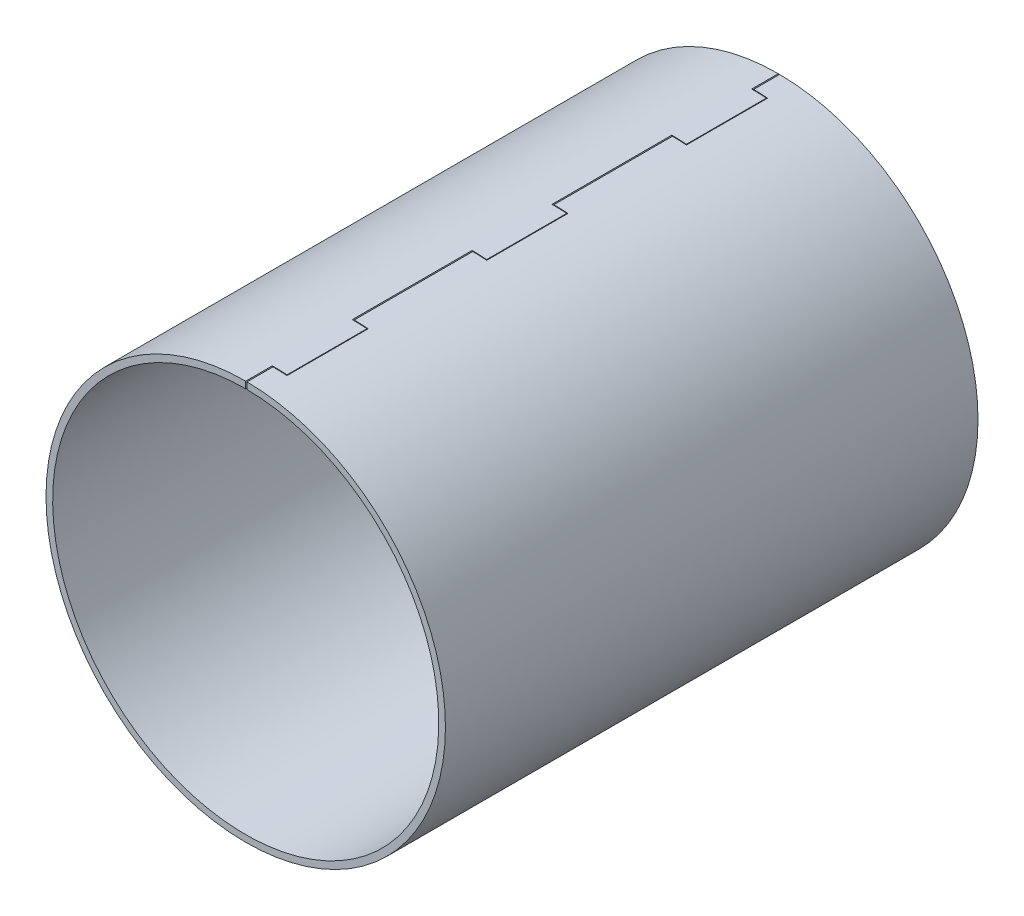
ISO-10303-21;
HEADER;
FILE_DESCRIPTION(('STEP AP214'),'2;1');
FILE_NAME('part.step','',(''),(''),'','','');
FILE_SCHEMA(('AUTOMOTIVE_DESIGN { 1 0 10303 214 1 1 1 1 }'));
ENDSEC;
DATA;
#1=APPLICATION_CONTEXT('core data for automotive mechanical design processes');
#2=APPLICATION_PROTOCOL_DEFINITION('international standard','automotive_design',2000,#1);
#3=PRODUCT_CONTEXT('',#1,'mechanical');
#4=PRODUCT('Part','Part','',(#3));
#5=PRODUCT_RELATED_PRODUCT_CATEGORY('part','',(#4));
#6=PRODUCT_DEFINITION_FORMATION('','',#4);
#7=PRODUCT_DEFINITION_CONTEXT('part definition',#1,'design');
#8=PRODUCT_DEFINITION('design','',#6,#7);
#9=PRODUCT_DEFINITION_SHAPE('','',#8);
#10=(LENGTH_UNIT() NAMED_UNIT(*) SI_UNIT(.MILLI.,.METRE.));
#11=(NAMED_UNIT(*) PLANE_ANGLE_UNIT() SI_UNIT($,.RADIAN.));
#12=(NAMED_UNIT(*) SI_UNIT($,.STERADIAN.) SOLID_ANGLE_UNIT());
#13=UNCERTAINTY_MEASURE_WITH_UNIT(LENGTH_MEASURE(1.E-05),#10,'distance_accuracy_value','');
#14=(GEOMETRIC_REPRESENTATION_CONTEXT(3) GLOBAL_UNCERTAINTY_ASSIGNED_CONTEXT((#13)) GLOBAL_UNIT_ASSIGNED_CONTEXT((#10,
#11,#12)) REPRESENTATION_CONTEXT('',''));
#15=CARTESIAN_POINT('',(0.,0.,0.));
#16=DIRECTION('',(0.,0.,1.));
#17=DIRECTION('',(1.,0.,0.));
#18=AXIS2_PLACEMENT_3D('',#15,#16,#17);
#19=CARTESIAN_POINT('',(0.,150.,400.));
#20=DIRECTION('',(1.,0.,0.));
#21=DIRECTION('',(0.,1.,0.));
#22=AXIS2_PLACEMENT_3D('',#19,#20,#21);
#23=PLANE('',#22);
#24=DIRECTION('',(0.,0.,-1.));
#25=VECTOR('',#24,1.);
#26=CARTESIAN_POINT('',(0.,145.,400.));
#27=LINE('',#26,#25);
#28=CARTESIAN_POINT('',(0.,145.,170.));
#29=VERTEX_POINT('',#28);
#30=CARTESIAN_POINT('',(0.,145.,80.));
#31=VERTEX_POINT('',#30);
#32=EDGE_CURVE('E270',#29,#31,#27,.T.);
#33=ORIENTED_EDGE('',*,*,#32,.T.);
#34=CARTESIAN_POINT('',(0.,145.,80.));
#35=CARTESIAN_POINT('',(0.,150.,80.));
#36=B_SPLINE_CURVE_WITH_KNOTS('',1,(#34,#35),.UNSPECIFIED.,.F.,.F.,(2,2),(0.,
0.0384615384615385),.UNSPECIFIED.);
#37=CARTESIAN_POINT('',(0.,150.,80.));
#38=VERTEX_POINT('',#37);
#39=EDGE_CURVE('E274',#31,#38,#36,.T.);
#40=ORIENTED_EDGE('',*,*,#39,.T.);
#41=DIRECTION('',(0.,0.,-1.));
#42=VECTOR('',#41,1.);
#43=CARTESIAN_POINT('',(0.,150.,400.));
#44=LINE('',#43,#42);
#45=CARTESIAN_POINT('',(0.,150.,170.));
#46=VERTEX_POINT('',#45);
#47=EDGE_CURVE('E436',#46,#38,#44,.T.);
#48=ORIENTED_EDGE('',*,*,#47,.F.);
#49=CARTESIAN_POINT('',(0.,150.,170.));
#50=CARTESIAN_POINT('',(0.,145.,170.));
#51=B_SPLINE_CURVE_WITH_KNOTS('',1,(#49,#50),.UNSPECIFIED.,.F.,.F.,(2,2),(0.5,
0.538461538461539),.UNSPECIFIED.);
#52=EDGE_CURVE('E284',#46,#29,#51,.T.);
#53=ORIENTED_EDGE('',*,*,#52,.T.);
#54=EDGE_LOOP('',(#33,#40,#48,#53));
#55=FACE_BOUND('',#54,.T.);
#56=ADVANCED_FACE('F75',(#55),#23,.T.);
#57=CARTESIAN_POINT('',(0.,150.,20.));
#58=VERTEX_POINT('',#57);
#59=CARTESIAN_POINT('',(0.,150.,0.));
#60=VERTEX_POINT('',#59);
#61=EDGE_CURVE('E403',#58,#60,#44,.T.);
#62=ORIENTED_EDGE('',*,*,#61,.F.);
#63=CARTESIAN_POINT('',(0.,150.,20.));
#64=CARTESIAN_POINT('',(0.,145.,20.));
#65=B_SPLINE_CURVE_WITH_KNOTS('',1,(#63,#64),.UNSPECIFIED.,.F.,.F.,(2,2),(0.5,
0.538461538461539),.UNSPECIFIED.);
#66=CARTESIAN_POINT('',(0.,145.,20.));
#67=VERTEX_POINT('',#66);
#68=EDGE_CURVE('E421',#58,#67,#65,.T.);
#69=ORIENTED_EDGE('',*,*,#68,.T.);
#70=CARTESIAN_POINT('',(0.,145.,0.));
#71=VERTEX_POINT('',#70);
#72=EDGE_CURVE('E286',#67,#71,#27,.T.);
#73=ORIENTED_EDGE('',*,*,#72,.T.);
#74=DIRECTION('',(0.,-1.,0.));
#75=VECTOR('',#74,1.);
#76=CARTESIAN_POINT('',(0.,150.,0.));
#77=LINE('',#76,#75);
#78=EDGE_CURVE('E394',#60,#71,#77,.T.);
#79=ORIENTED_EDGE('',*,*,#78,.F.);
#80=EDGE_LOOP('',(#62,#69,#73,#79));
#81=FACE_BOUND('',#80,.T.);
#82=ADVANCED_FACE('F419',(#81),#23,.T.);
#83=CARTESIAN_POINT('',(0.,145.,320.));
#84=VERTEX_POINT('',#83);
#85=CARTESIAN_POINT('',(0.,145.,230.));
#86=VERTEX_POINT('',#85);
#87=EDGE_CURVE('E285',#84,#86,#27,.T.);
#88=ORIENTED_EDGE('',*,*,#87,.T.);
#89=CARTESIAN_POINT('',(0.,145.,230.));
#90=CARTESIAN_POINT('',(0.,150.,230.));
#91=B_SPLINE_CURVE_WITH_KNOTS('',1,(#89,#90),.UNSPECIFIED.,.F.,.F.,(2,2),(0.,
0.0384615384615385),.UNSPECIFIED.);
#92=CARTESIAN_POINT('',(0.,150.,230.));
#93=VERTEX_POINT('',#92);
#94=EDGE_CURVE('E457',#86,#93,#91,.T.);
#95=ORIENTED_EDGE('',*,*,#94,.T.);
#96=CARTESIAN_POINT('',(0.,150.,320.));
#97=VERTEX_POINT('',#96);
#98=EDGE_CURVE('E437',#97,#93,#44,.T.);
#99=ORIENTED_EDGE('',*,*,#98,.F.);
#100=CARTESIAN_POINT('',(0.,150.,320.));
#101=CARTESIAN_POINT('',(0.,145.,320.));
#102=B_SPLINE_CURVE_WITH_KNOTS('',1,(#100,#101),.UNSPECIFIED.,.F.,.F.,(2,2),(0.5,
0.538461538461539),.UNSPECIFIED.);
#103=EDGE_CURVE('E454',#97,#84,#102,.T.);
#104=ORIENTED_EDGE('',*,*,#103,.T.);
#105=EDGE_LOOP('',(#88,#95,#99,#104));
#106=FACE_BOUND('',#105,.T.);
#107=ADVANCED_FACE('F453',(#106),#23,.T.);
#108=CARTESIAN_POINT('',(0.,145.,400.));
#109=VERTEX_POINT('',#108);
#110=CARTESIAN_POINT('',(0.,145.,380.));
#111=VERTEX_POINT('',#110);
#112=EDGE_CURVE('E289',#109,#111,#27,.T.);
#113=ORIENTED_EDGE('',*,*,#112,.T.);
#114=CARTESIAN_POINT('',(0.,145.,380.));
#115=CARTESIAN_POINT('',(0.,150.,380.));
#116=B_SPLINE_CURVE_WITH_KNOTS('',1,(#114,#115),.UNSPECIFIED.,.F.,.F.,(2,2),(0.,
0.0384615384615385),.UNSPECIFIED.);
#117=CARTESIAN_POINT('',(0.,150.,380.));
#118=VERTEX_POINT('',#117);
#119=EDGE_CURVE('E493',#111,#118,#116,.T.);
#120=ORIENTED_EDGE('',*,*,#119,.T.);
#121=CARTESIAN_POINT('',(0.,150.,400.));
#122=VERTEX_POINT('',#121);
#123=EDGE_CURVE('E290',#122,#118,#44,.T.);
#124=ORIENTED_EDGE('',*,*,#123,.F.);
#125=DIRECTION('',(0.,-1.,0.));
#126=VECTOR('',#125,1.);
#127=CARTESIAN_POINT('',(0.,150.,400.));
#128=LINE('',#127,#126);
#129=EDGE_CURVE('E400',#122,#109,#128,.T.);
#130=ORIENTED_EDGE('',*,*,#129,.T.);
#131=EDGE_LOOP('',(#113,#120,#124,#130));
#132=FACE_BOUND('',#131,.T.);
#133=ADVANCED_FACE('F562',(#132),#23,.T.);
#134=CARTESIAN_POINT('',(0.966666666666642,144.996777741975,400.));
#135=DIRECTION('',(-0.999977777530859,0.00666666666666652,0.));
#136=DIRECTION('',(-0.00666666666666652,-0.999977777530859,0.));
#137=AXIS2_PLACEMENT_3D('',#134,#135,#136);
#138=PLANE('',#137);
#139=DIRECTION('',(0.00666666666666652,0.999977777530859,0.));
#140=VECTOR('',#139,1.);
#141=CARTESIAN_POINT('',(0.966666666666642,144.996777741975,380.5));
#142=LINE('',#141,#140);
#143=CARTESIAN_POINT('',(0.966666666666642,144.996777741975,380.5));
#144=VERTEX_POINT('',#143);
#145=CARTESIAN_POINT('',(0.999999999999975,149.996666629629,380.5));
#146=VERTEX_POINT('',#145);
#147=EDGE_CURVE('E379',#144,#146,#142,.T.);
#148=ORIENTED_EDGE('',*,*,#147,.F.);
#149=DIRECTION('',(0.,0.,-1.));
#150=VECTOR('',#149,1.);
#151=CARTESIAN_POINT('',(0.966666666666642,144.996777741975,400.));
#152=LINE('',#151,#150);
#153=CARTESIAN_POINT('',(0.966666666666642,144.996777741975,400.));
#154=VERTEX_POINT('',#153);
#155=EDGE_CURVE('E296',#154,#144,#152,.T.);
#156=ORIENTED_EDGE('',*,*,#155,.F.);
#157=DIRECTION('',(0.00666666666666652,0.999977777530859,0.));
#158=VECTOR('',#157,1.);
#159=CARTESIAN_POINT('',(0.966666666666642,144.996777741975,400.));
#160=LINE('',#159,#158);
#161=CARTESIAN_POINT('',(0.999999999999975,149.996666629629,400.));
#162=VERTEX_POINT('',#161);
#163=EDGE_CURVE('E393',#154,#162,#160,.T.);
#164=ORIENTED_EDGE('',*,*,#163,.T.);
#165=DIRECTION('',(0.,0.,-1.));
#166=VECTOR('',#165,1.);
#167=CARTESIAN_POINT('',(0.999999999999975,149.996666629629,400.));
#168=LINE('',#167,#166);
#169=EDGE_CURVE('E301',#162,#146,#168,.T.);
#170=ORIENTED_EDGE('',*,*,#169,.T.);
#171=EDGE_LOOP('',(#148,#156,#164,#170));
#172=FACE_BOUND('',#171,.T.);
#173=ADVANCED_FACE('F522',(#172),#138,.T.);
#174=DIRECTION('',(-0.00666666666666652,-0.999977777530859,0.));
#175=VECTOR('',#174,1.);
#176=CARTESIAN_POINT('',(0.966666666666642,144.996777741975,319.5));
#177=LINE('',#176,#175);
#178=CARTESIAN_POINT('',(0.999999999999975,149.996666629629,319.5));
#179=VERTEX_POINT('',#178);
#180=CARTESIAN_POINT('',(0.966666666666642,144.996777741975,319.5));
#181=VERTEX_POINT('',#180);
#182=EDGE_CURVE('E372',#179,#181,#177,.T.);
#183=ORIENTED_EDGE('',*,*,#182,.F.);
#184=CARTESIAN_POINT('',(0.999999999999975,149.996666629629,230.5));
#185=VERTEX_POINT('',#184);
#186=EDGE_CURVE('E305',#179,#185,#168,.T.);
#187=ORIENTED_EDGE('',*,*,#186,.T.);
#188=DIRECTION('',(0.00666666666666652,0.999977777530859,0.));
#189=VECTOR('',#188,1.);
#190=CARTESIAN_POINT('',(0.966666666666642,144.996777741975,230.5));
#191=LINE('',#190,#189);
#192=CARTESIAN_POINT('',(0.966666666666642,144.996777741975,230.5));
#193=VERTEX_POINT('',#192);
#194=EDGE_CURVE('E366',#193,#185,#191,.T.);
#195=ORIENTED_EDGE('',*,*,#194,.F.);
#196=EDGE_CURVE('E300',#181,#193,#152,.T.);
#197=ORIENTED_EDGE('',*,*,#196,.F.);
#198=EDGE_LOOP('',(#183,#187,#195,#197));
#199=FACE_BOUND('',#198,.T.);
#200=ADVANCED_FACE('F534',(#199),#138,.T.);
#201=DIRECTION('',(-0.00666666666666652,-0.999977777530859,0.));
#202=VECTOR('',#201,1.);
#203=CARTESIAN_POINT('',(0.966666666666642,144.996777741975,169.5));
#204=LINE('',#203,#202);
#205=CARTESIAN_POINT('',(0.999999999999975,149.996666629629,169.5));
#206=VERTEX_POINT('',#205);
#207=CARTESIAN_POINT('',(0.966666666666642,144.996777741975,169.5));
#208=VERTEX_POINT('',#207);
#209=EDGE_CURVE('E360',#206,#208,#204,.T.);
#210=ORIENTED_EDGE('',*,*,#209,.F.);
#211=CARTESIAN_POINT('',(0.999999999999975,149.996666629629,80.5));
#212=VERTEX_POINT('',#211);
#213=EDGE_CURVE('E431',#206,#212,#168,.T.);
#214=ORIENTED_EDGE('',*,*,#213,.T.);
#215=DIRECTION('',(0.00666666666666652,0.999977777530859,0.));
#216=VECTOR('',#215,1.);
#217=CARTESIAN_POINT('',(0.966666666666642,144.996777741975,80.5));
#218=LINE('',#217,#216);
#219=CARTESIAN_POINT('',(0.966666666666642,144.996777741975,80.5));
#220=VERTEX_POINT('',#219);
#221=EDGE_CURVE('E354',#220,#212,#218,.T.);
#222=ORIENTED_EDGE('',*,*,#221,.F.);
#223=EDGE_CURVE('E427',#208,#220,#152,.T.);
#224=ORIENTED_EDGE('',*,*,#223,.F.);
#225=EDGE_LOOP('',(#210,#214,#222,#224));
#226=FACE_BOUND('',#225,.T.);
#227=ADVANCED_FACE('F540',(#226),#138,.T.);
#228=CARTESIAN_POINT('',(0.,0.,400.));
#229=DIRECTION('',(0.,0.,-1.));
#230=DIRECTION('',(-1.,0.,0.));
#231=AXIS2_PLACEMENT_3D('',#228,#229,#230);
#232=CYLINDRICAL_SURFACE('',#231,150.);
#233=DIRECTION('',(0.,0.,-1.));
#234=VECTOR('',#233,1.);
#235=CARTESIAN_POINT('',(11.4881439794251,149.559428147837,400.));
#236=LINE('',#235,#234);
#237=CARTESIAN_POINT('',(11.4881439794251,149.559428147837,380.5));
#238=VERTEX_POINT('',#237);
#239=CARTESIAN_POINT('',(11.4881439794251,149.559428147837,319.5));
#240=VERTEX_POINT('',#239);
#241=EDGE_CURVE('E388',#238,#240,#236,.T.);
#242=ORIENTED_EDGE('',*,*,#241,.F.);
#243=CARTESIAN_POINT('',(0.,0.,380.5));
#244=DIRECTION('',(0.,0.,1.));
#245=DIRECTION('',(1.,0.,0.));
#246=AXIS2_PLACEMENT_3D('',#243,#244,#245);
#247=CIRCLE('',#246,150.);
#248=EDGE_CURVE('E381',#238,#146,#247,.T.);
#249=ORIENTED_EDGE('',*,*,#248,.T.);
#250=ORIENTED_EDGE('',*,*,#169,.F.);
#251=CARTESIAN_POINT('',(0.,0.,400.));
#252=DIRECTION('',(0.,0.,1.));
#253=DIRECTION('',(1.,0.,0.));
#254=AXIS2_PLACEMENT_3D('',#251,#252,#253);
#255=CIRCLE('',#254,150.);
#256=EDGE_CURVE('E391',#122,#162,#255,.T.);
#257=ORIENTED_EDGE('',*,*,#256,.F.);
#258=ORIENTED_EDGE('',*,*,#123,.T.);
#259=CARTESIAN_POINT('',(0.,0.,380.));
#260=DIRECTION('',(0.,0.,1.));
#261=DIRECTION('',(0.1098925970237,0.993943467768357,0.));
#262=AXIS2_PLACEMENT_3D('',#259,#260,#261);
#263=CIRCLE('',#262,150.);
#264=CARTESIAN_POINT('',(10.9896315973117,149.596884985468,380.));
#265=VERTEX_POINT('',#264);
#266=EDGE_CURVE('E498',#265,#118,#263,.T.);
#267=ORIENTED_EDGE('',*,*,#266,.F.);
#268=DIRECTION('',(0.,0.,1.));
#269=VECTOR('',#268,1.);
#270=CARTESIAN_POINT('',(10.9896315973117,149.596884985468,0.));
#271=LINE('',#270,#269);
#272=CARTESIAN_POINT('',(10.9896315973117,149.596884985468,320.));
#273=VERTEX_POINT('',#272);
#274=EDGE_CURVE('E488',#273,#265,#271,.T.);
#275=ORIENTED_EDGE('',*,*,#274,.F.);
#276=CARTESIAN_POINT('',(0.,0.,320.));
#277=DIRECTION('',(0.,0.,1.));
#278=DIRECTION('',(0.1098925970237,0.993943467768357,0.));
#279=AXIS2_PLACEMENT_3D('',#276,#277,#278);
#280=CIRCLE('',#279,150.);
#281=EDGE_CURVE('E448',#273,#97,#280,.T.);
#282=ORIENTED_EDGE('',*,*,#281,.T.);
#283=ORIENTED_EDGE('',*,*,#98,.T.);
#284=CARTESIAN_POINT('',(0.,0.,230.));
#285=DIRECTION('',(0.,0.,1.));
#286=DIRECTION('',(0.1098925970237,0.993943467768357,0.));
#287=AXIS2_PLACEMENT_3D('',#284,#285,#286);
#288=CIRCLE('',#287,150.);
#289=CARTESIAN_POINT('',(10.9896315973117,149.596884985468,230.));
#290=VERTEX_POINT('',#289);
#291=EDGE_CURVE('E445',#290,#93,#288,.T.);
#292=ORIENTED_EDGE('',*,*,#291,.F.);
#293=DIRECTION('',(0.,0.,1.));
#294=VECTOR('',#293,1.);
#295=CARTESIAN_POINT('',(10.9896315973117,149.596884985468,0.));
#296=LINE('',#295,#294);
#297=CARTESIAN_POINT('',(10.9896315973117,149.596884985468,170.));
#298=VERTEX_POINT('',#297);
#299=EDGE_CURVE('E589',#298,#290,#296,.T.);
#300=ORIENTED_EDGE('',*,*,#299,.F.);
#301=CARTESIAN_POINT('',(0.,0.,170.));
#302=DIRECTION('',(0.,0.,1.));
#303=DIRECTION('',(0.1098925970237,0.993943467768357,0.));
#304=AXIS2_PLACEMENT_3D('',#301,#302,#303);
#305=CIRCLE('',#304,150.);
#306=EDGE_CURVE('E462',#298,#46,#305,.T.);
#307=ORIENTED_EDGE('',*,*,#306,.T.);
#308=ORIENTED_EDGE('',*,*,#47,.T.);
#309=CARTESIAN_POINT('',(0.,0.,80.));
#310=DIRECTION('',(0.,0.,1.));
#311=DIRECTION('',(0.1098925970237,0.993943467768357,0.));
#312=AXIS2_PLACEMENT_3D('',#309,#310,#311);
#313=CIRCLE('',#312,150.);
#314=CARTESIAN_POINT('',(10.9896315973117,149.596884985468,80.));
#315=VERTEX_POINT('',#314);
#316=EDGE_CURVE('E279',#315,#38,#313,.T.);
#317=ORIENTED_EDGE('',*,*,#316,.F.);
#318=DIRECTION('',(0.,0.,1.));
#319=VECTOR('',#318,1.);
#320=CARTESIAN_POINT('',(10.9896315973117,149.596884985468,0.));
#321=LINE('',#320,#319);
#322=CARTESIAN_POINT('',(10.9896315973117,149.596884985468,20.));
#323=VERTEX_POINT('',#322);
#324=EDGE_CURVE('E610',#323,#315,#321,.T.);
#325=ORIENTED_EDGE('',*,*,#324,.F.);
#326=CARTESIAN_POINT('',(0.,0.,20.));
#327=DIRECTION('',(0.,0.,1.));
#328=DIRECTION('',(0.1098925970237,0.993943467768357,0.));
#329=AXIS2_PLACEMENT_3D('',#326,#327,#328);
#330=CIRCLE('',#329,150.);
#331=EDGE_CURVE('E435',#323,#58,#330,.T.);
#332=ORIENTED_EDGE('',*,*,#331,.T.);
#333=ORIENTED_EDGE('',*,*,#61,.T.);
#334=CARTESIAN_POINT('',(0.,0.,0.));
#335=DIRECTION('',(0.,0.,1.));
#336=DIRECTION('',(1.,0.,0.));
#337=AXIS2_PLACEMENT_3D('',#334,#335,#336);
#338=CIRCLE('',#337,150.);
#339=CARTESIAN_POINT('',(0.999999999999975,149.996666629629,0.));
#340=VERTEX_POINT('',#339);
#341=EDGE_CURVE('E390',#60,#340,#338,.T.);
#342=ORIENTED_EDGE('',*,*,#341,.T.);
#343=CARTESIAN_POINT('',(0.999999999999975,149.996666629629,19.5));
#344=VERTEX_POINT('',#343);
#345=EDGE_CURVE('E299',#344,#340,#168,.T.);
#346=ORIENTED_EDGE('',*,*,#345,.F.);
#347=CARTESIAN_POINT('',(0.,0.,19.5));
#348=DIRECTION('',(0.,0.,-1.));
#349=DIRECTION('',(-1.,0.,0.));
#350=AXIS2_PLACEMENT_3D('',#347,#348,#349);
#351=CIRCLE('',#350,150.);
#352=CARTESIAN_POINT('',(11.4881439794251,149.559428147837,19.5));
#353=VERTEX_POINT('',#352);
#354=EDGE_CURVE('E349',#344,#353,#351,.T.);
#355=ORIENTED_EDGE('',*,*,#354,.T.);
#356=DIRECTION('',(0.,0.,-1.));
#357=VECTOR('',#356,1.);
#358=CARTESIAN_POINT('',(11.4881439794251,149.559428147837,400.));
#359=LINE('',#358,#357);
#360=CARTESIAN_POINT('',(11.4881439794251,149.559428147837,80.5));
#361=VERTEX_POINT('',#360);
#362=EDGE_CURVE('E384',#361,#353,#359,.T.);
#363=ORIENTED_EDGE('',*,*,#362,.F.);
#364=CARTESIAN_POINT('',(0.,0.,80.5));
#365=DIRECTION('',(0.,0.,1.));
#366=DIRECTION('',(1.,0.,0.));
#367=AXIS2_PLACEMENT_3D('',#364,#365,#366);
#368=CIRCLE('',#367,150.);
#369=EDGE_CURVE('E356',#361,#212,#368,.T.);
#370=ORIENTED_EDGE('',*,*,#369,.T.);
#371=ORIENTED_EDGE('',*,*,#213,.F.);
#372=CARTESIAN_POINT('',(0.,0.,169.5));
#373=DIRECTION('',(0.,0.,-1.));
#374=DIRECTION('',(-1.,0.,0.));
#375=AXIS2_PLACEMENT_3D('',#372,#373,#374);
#376=CIRCLE('',#375,150.);
#377=CARTESIAN_POINT('',(11.4881439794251,149.559428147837,169.5));
#378=VERTEX_POINT('',#377);
#379=EDGE_CURVE('E362',#206,#378,#376,.T.);
#380=ORIENTED_EDGE('',*,*,#379,.T.);
#381=DIRECTION('',(0.,0.,-1.));
#382=VECTOR('',#381,1.);
#383=CARTESIAN_POINT('',(11.4881439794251,149.559428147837,400.));
#384=LINE('',#383,#382);
#385=CARTESIAN_POINT('',(11.4881439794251,149.559428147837,230.5));
#386=VERTEX_POINT('',#385);
#387=EDGE_CURVE('E386',#386,#378,#384,.T.);
#388=ORIENTED_EDGE('',*,*,#387,.F.);
#389=CARTESIAN_POINT('',(0.,0.,230.5));
#390=DIRECTION('',(0.,0.,1.));
#391=DIRECTION('',(1.,0.,0.));
#392=AXIS2_PLACEMENT_3D('',#389,#390,#391);
#393=CIRCLE('',#392,150.);
#394=EDGE_CURVE('E328',#386,#185,#393,.T.);
#395=ORIENTED_EDGE('',*,*,#394,.T.);
#396=ORIENTED_EDGE('',*,*,#186,.F.);
#397=CARTESIAN_POINT('',(0.,0.,319.5));
#398=DIRECTION('',(0.,0.,-1.));
#399=DIRECTION('',(-1.,0.,0.));
#400=AXIS2_PLACEMENT_3D('',#397,#398,#399);
#401=CIRCLE('',#400,150.);
#402=EDGE_CURVE('E374',#179,#240,#401,.T.);
#403=ORIENTED_EDGE('',*,*,#402,.T.);
#404=EDGE_LOOP('',(#242,#249,#250,#257,#258,#267,#275,#282,#283,#292,#300,#307,#308,#317,#325,
#332,#333,#342,#346,#355,#363,#370,#371,#380,#388,#395,#396,#403));
#405=FACE_BOUND('',#404,.T.);
#406=ADVANCED_FACE('F77',(#405),#232,.T.);
#407=DIRECTION('',(-0.00666666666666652,-0.999977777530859,0.));
#408=VECTOR('',#407,1.);
#409=CARTESIAN_POINT('',(0.966666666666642,144.996777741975,19.5));
#410=LINE('',#409,#408);
#411=CARTESIAN_POINT('',(0.966666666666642,144.996777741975,19.5));
#412=VERTEX_POINT('',#411);
#413=EDGE_CURVE('E347',#344,#412,#410,.T.);
#414=ORIENTED_EDGE('',*,*,#413,.F.);
#415=ORIENTED_EDGE('',*,*,#345,.T.);
#416=DIRECTION('',(0.00666666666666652,0.999977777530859,0.));
#417=VECTOR('',#416,1.);
#418=CARTESIAN_POINT('',(0.966666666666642,144.996777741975,0.));
#419=LINE('',#418,#417);
#420=CARTESIAN_POINT('',(0.966666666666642,144.996777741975,0.));
#421=VERTEX_POINT('',#420);
#422=EDGE_CURVE('E406',#421,#340,#419,.T.);
#423=ORIENTED_EDGE('',*,*,#422,.F.);
#424=EDGE_CURVE('E294',#412,#421,#152,.T.);
#425=ORIENTED_EDGE('',*,*,#424,.F.);
#426=EDGE_LOOP('',(#414,#415,#423,#425));
#427=FACE_BOUND('',#426,.T.);
#428=ADVANCED_FACE('F428',(#427),#138,.T.);
#429=CARTESIAN_POINT('',(0.,0.,400.));
#430=DIRECTION('',(0.,0.,-1.));
#431=DIRECTION('',(-1.,0.,0.));
#432=AXIS2_PLACEMENT_3D('',#429,#430,#431);
#433=CYLINDRICAL_SURFACE('',#432,145.);
#434=CARTESIAN_POINT('',(0.,0.,380.5));
#435=DIRECTION('',(0.,0.,1.));
#436=DIRECTION('',(1.,0.,0.));
#437=AXIS2_PLACEMENT_3D('',#434,#435,#436);
#438=CIRCLE('',#437,145.);
#439=CARTESIAN_POINT('',(11.4547259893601,144.546841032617,380.5));
#440=VERTEX_POINT('',#439);
#441=EDGE_CURVE('E377',#440,#144,#438,.T.);
#442=ORIENTED_EDGE('',*,*,#441,.F.);
#443=DIRECTION('',(0.,0.,-1.));
#444=VECTOR('',#443,1.);
#445=CARTESIAN_POINT('',(11.4547259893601,144.546841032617,400.));
#446=LINE('',#445,#444);
#447=CARTESIAN_POINT('',(11.4547259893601,144.546841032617,319.5));
#448=VERTEX_POINT('',#447);
#449=EDGE_CURVE('E13',#440,#448,#446,.T.);
#450=ORIENTED_EDGE('',*,*,#449,.T.);
#451=CARTESIAN_POINT('',(0.,0.,319.5));
#452=DIRECTION('',(0.,0.,-1.));
#453=DIRECTION('',(-1.,0.,0.));
#454=AXIS2_PLACEMENT_3D('',#451,#452,#453);
#455=CIRCLE('',#454,145.);
#456=EDGE_CURVE('E369',#181,#448,#455,.T.);
#457=ORIENTED_EDGE('',*,*,#456,.F.);
#458=ORIENTED_EDGE('',*,*,#196,.T.);
#459=CARTESIAN_POINT('',(0.,0.,230.5));
#460=DIRECTION('',(0.,0.,1.));
#461=DIRECTION('',(1.,0.,0.));
#462=AXIS2_PLACEMENT_3D('',#459,#460,#461);
#463=CIRCLE('',#462,145.);
#464=CARTESIAN_POINT('',(11.4547259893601,144.546841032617,230.5));
#465=VERTEX_POINT('',#464);
#466=EDGE_CURVE('E315',#465,#193,#463,.T.);
#467=ORIENTED_EDGE('',*,*,#466,.F.);
#468=DIRECTION('',(0.,0.,-1.));
#469=VECTOR('',#468,1.);
#470=CARTESIAN_POINT('',(11.4547259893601,144.546841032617,400.));
#471=LINE('',#470,#469);
#472=CARTESIAN_POINT('',(11.4547259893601,144.546841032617,169.5));
#473=VERTEX_POINT('',#472);
#474=EDGE_CURVE('E83',#465,#473,#471,.T.);
#475=ORIENTED_EDGE('',*,*,#474,.T.);
#476=CARTESIAN_POINT('',(0.,0.,169.5));
#477=DIRECTION('',(0.,0.,-1.));
#478=DIRECTION('',(-1.,0.,0.));
#479=AXIS2_PLACEMENT_3D('',#476,#477,#478);
#480=CIRCLE('',#479,145.);
#481=EDGE_CURVE('E312',#208,#473,#480,.T.);
#482=ORIENTED_EDGE('',*,*,#481,.F.);
#483=ORIENTED_EDGE('',*,*,#223,.T.);
#484=CARTESIAN_POINT('',(0.,0.,80.5));
#485=DIRECTION('',(0.,0.,1.));
#486=DIRECTION('',(1.,0.,0.));
#487=AXIS2_PLACEMENT_3D('',#484,#485,#486);
#488=CIRCLE('',#487,145.);
#489=CARTESIAN_POINT('',(11.4547259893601,144.546841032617,80.5));
#490=VERTEX_POINT('',#489);
#491=EDGE_CURVE('E352',#490,#220,#488,.T.);
#492=ORIENTED_EDGE('',*,*,#491,.F.);
#493=DIRECTION('',(0.,0.,-1.));
#494=VECTOR('',#493,1.);
#495=CARTESIAN_POINT('',(11.4547259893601,144.546841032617,400.));
#496=LINE('',#495,#494);
#497=CARTESIAN_POINT('',(11.4547259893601,144.546841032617,19.4999999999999));
#498=VERTEX_POINT('',#497);
#499=EDGE_CURVE('E304',#490,#498,#496,.T.);
#500=ORIENTED_EDGE('',*,*,#499,.T.);
#501=CARTESIAN_POINT('',(0.,0.,19.5));
#502=DIRECTION('',(0.,0.,-1.));
#503=DIRECTION('',(-1.,0.,0.));
#504=AXIS2_PLACEMENT_3D('',#501,#502,#503);
#505=CIRCLE('',#504,145.);
#506=EDGE_CURVE('E344',#412,#498,#505,.T.);
#507=ORIENTED_EDGE('',*,*,#506,.F.);
#508=ORIENTED_EDGE('',*,*,#424,.T.);
#509=CARTESIAN_POINT('',(0.,0.,0.));
#510=DIRECTION('',(0.,0.,1.));
#511=DIRECTION('',(1.,0.,0.));
#512=AXIS2_PLACEMENT_3D('',#509,#510,#511);
#513=CIRCLE('',#512,145.);
#514=EDGE_CURVE('E409',#71,#421,#513,.T.);
#515=ORIENTED_EDGE('',*,*,#514,.F.);
#516=ORIENTED_EDGE('',*,*,#72,.F.);
#517=CARTESIAN_POINT('',(0.,0.,20.));
#518=DIRECTION('',(0.,0.,1.));
#519=DIRECTION('',(0.1098925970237,0.993943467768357,0.));
#520=AXIS2_PLACEMENT_3D('',#517,#518,#519);
#521=CIRCLE('',#520,145.);
#522=CARTESIAN_POINT('',(10.9562214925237,144.585480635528,20.));
#523=VERTEX_POINT('',#522);
#524=EDGE_CURVE('E90',#523,#67,#521,.T.);
#525=ORIENTED_EDGE('',*,*,#524,.F.);
#526=DIRECTION('',(0.,0.,1.));
#527=VECTOR('',#526,1.);
#528=CARTESIAN_POINT('',(10.9562214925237,144.585480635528,0.));
#529=LINE('',#528,#527);
#530=CARTESIAN_POINT('',(10.9562214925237,144.585480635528,80.));
#531=VERTEX_POINT('',#530);
#532=EDGE_CURVE('E271',#531,#523,#529,.F.);
#533=ORIENTED_EDGE('',*,*,#532,.F.);
#534=CARTESIAN_POINT('',(0.,0.,80.));
#535=DIRECTION('',(0.,0.,1.));
#536=DIRECTION('',(0.1098925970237,0.993943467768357,0.));
#537=AXIS2_PLACEMENT_3D('',#534,#535,#536);
#538=CIRCLE('',#537,145.);
#539=EDGE_CURVE('E265',#531,#31,#538,.T.);
#540=ORIENTED_EDGE('',*,*,#539,.T.);
#541=ORIENTED_EDGE('',*,*,#32,.F.);
#542=CARTESIAN_POINT('',(0.,0.,170.));
#543=DIRECTION('',(0.,0.,1.));
#544=DIRECTION('',(0.1098925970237,0.993943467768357,0.));
#545=AXIS2_PLACEMENT_3D('',#542,#543,#544);
#546=CIRCLE('',#545,145.);
#547=CARTESIAN_POINT('',(10.9562214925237,144.585480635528,170.));
#548=VERTEX_POINT('',#547);
#549=EDGE_CURVE('E98',#548,#29,#546,.T.);
#550=ORIENTED_EDGE('',*,*,#549,.F.);
#551=DIRECTION('',(0.,0.,1.));
#552=VECTOR('',#551,1.);
#553=CARTESIAN_POINT('',(10.9562214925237,144.585480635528,0.));
#554=LINE('',#553,#552);
#555=CARTESIAN_POINT('',(10.9562214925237,144.585480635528,230.));
#556=VERTEX_POINT('',#555);
#557=EDGE_CURVE('E483',#556,#548,#554,.F.);
#558=ORIENTED_EDGE('',*,*,#557,.F.);
#559=CARTESIAN_POINT('',(0.,0.,230.));
#560=DIRECTION('',(0.,0.,1.));
#561=DIRECTION('',(0.1098925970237,0.993943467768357,0.));
#562=AXIS2_PLACEMENT_3D('',#559,#560,#561);
#563=CIRCLE('',#562,145.);
#564=EDGE_CURVE('E460',#556,#86,#563,.T.);
#565=ORIENTED_EDGE('',*,*,#564,.T.);
#566=ORIENTED_EDGE('',*,*,#87,.F.);
#567=CARTESIAN_POINT('',(0.,0.,320.));
#568=DIRECTION('',(0.,0.,1.));
#569=DIRECTION('',(0.1098925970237,0.993943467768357,0.));
#570=AXIS2_PLACEMENT_3D('',#567,#568,#569);
#571=CIRCLE('',#570,145.);
#572=CARTESIAN_POINT('',(10.9562214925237,144.585480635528,320.));
#573=VERTEX_POINT('',#572);
#574=EDGE_CURVE('E489',#573,#84,#571,.T.);
#575=ORIENTED_EDGE('',*,*,#574,.F.);
#576=DIRECTION('',(0.,0.,1.));
#577=VECTOR('',#576,1.);
#578=CARTESIAN_POINT('',(10.9562214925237,144.585480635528,0.));
#579=LINE('',#578,#577);
#580=CARTESIAN_POINT('',(10.9562214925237,144.585480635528,380.));
#581=VERTEX_POINT('',#580);
#582=EDGE_CURVE('E341',#581,#573,#579,.F.);
#583=ORIENTED_EDGE('',*,*,#582,.F.);
#584=CARTESIAN_POINT('',(0.,0.,380.));
#585=DIRECTION('',(0.,0.,1.));
#586=DIRECTION('',(0.1098925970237,0.993943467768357,0.));
#587=AXIS2_PLACEMENT_3D('',#584,#585,#586);
#588=CIRCLE('',#587,145.);
#589=EDGE_CURVE('E485',#581,#111,#588,.T.);
#590=ORIENTED_EDGE('',*,*,#589,.T.);
#591=ORIENTED_EDGE('',*,*,#112,.F.);
#592=CARTESIAN_POINT('',(0.,0.,400.));
#593=DIRECTION('',(0.,0.,1.));
#594=DIRECTION('',(1.,0.,0.));
#595=AXIS2_PLACEMENT_3D('',#592,#593,#594);
#596=CIRCLE('',#595,145.);
#597=EDGE_CURVE('E397',#109,#154,#596,.T.);
#598=ORIENTED_EDGE('',*,*,#597,.T.);
#599=ORIENTED_EDGE('',*,*,#155,.T.);
#600=EDGE_LOOP('',(#442,#450,#457,#458,#467,#475,#482,#483,#492,#500,#507,#508,#515,#516,#525,
#533,#540,#541,#550,#558,#565,#566,#575,#583,#590,#591,#598,#599));
#601=FACE_BOUND('',#600,.T.);
#602=ADVANCED_FACE('F268',(#601),#433,.F.);
#603=CARTESIAN_POINT('',(0.,0.,400.));
#604=DIRECTION('',(0.,0.,1.));
#605=DIRECTION('',(1.,0.,0.));
#606=AXIS2_PLACEMENT_3D('',#603,#604,#605);
#607=PLANE('',#606);
#608=ORIENTED_EDGE('',*,*,#256,.T.);
#609=ORIENTED_EDGE('',*,*,#163,.F.);
#610=ORIENTED_EDGE('',*,*,#597,.F.);
#611=ORIENTED_EDGE('',*,*,#129,.F.);
#612=EDGE_LOOP('',(#608,#609,#610,#611));
#613=FACE_BOUND('',#612,.T.);
#614=ADVANCED_FACE('F524',(#613),#607,.T.);
#615=CARTESIAN_POINT('',(0.,0.,0.));
#616=DIRECTION('',(0.,0.,1.));
#617=DIRECTION('',(1.,0.,0.));
#618=AXIS2_PLACEMENT_3D('',#615,#616,#617);
#619=PLANE('',#618);
#620=ORIENTED_EDGE('',*,*,#341,.F.);
#621=ORIENTED_EDGE('',*,*,#78,.T.);
#622=ORIENTED_EDGE('',*,*,#514,.T.);
#623=ORIENTED_EDGE('',*,*,#422,.T.);
#624=EDGE_LOOP('',(#620,#621,#622,#623));
#625=FACE_BOUND('',#624,.T.);
#626=ADVANCED_FACE('F415',(#625),#619,.F.);
#627=CARTESIAN_POINT('',(11.4547259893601,144.546841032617,0.));
#628=DIRECTION('',(-0.999977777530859,0.00666666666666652,0.));
#629=DIRECTION('',(-0.00666666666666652,-0.999977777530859,0.));
#630=AXIS2_PLACEMENT_3D('',#627,#628,#629);
#631=PLANE('',#630);
#632=ORIENTED_EDGE('',*,*,#362,.T.);
#633=DIRECTION('',(0.00666666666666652,0.999977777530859,0.));
#634=VECTOR('',#633,1.);
#635=CARTESIAN_POINT('',(11.4885622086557,149.622161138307,19.5));
#636=LINE('',#635,#634);
#637=EDGE_CURVE('E338',#498,#353,#636,.T.);
#638=ORIENTED_EDGE('',*,*,#637,.F.);
#639=ORIENTED_EDGE('',*,*,#499,.F.);
#640=DIRECTION('',(-0.00666666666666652,-0.999977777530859,0.));
#641=VECTOR('',#640,1.);
#642=CARTESIAN_POINT('',(11.4487760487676,143.654369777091,80.5));
#643=LINE('',#642,#641);
#644=EDGE_CURVE('E334',#361,#490,#643,.T.);
#645=ORIENTED_EDGE('',*,*,#644,.F.);
#646=EDGE_LOOP('',(#632,#638,#639,#645));
#647=FACE_BOUND('',#646,.T.);
#648=ADVANCED_FACE('F548',(#647),#631,.T.);
#649=CARTESIAN_POINT('',(15.8794802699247,143.624831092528,80.5));
#650=DIRECTION('',(0.,0.,1.));
#651=DIRECTION('',(1.,0.,0.));
#652=AXIS2_PLACEMENT_3D('',#649,#650,#651);
#653=PLANE('',#652);
#654=ORIENTED_EDGE('',*,*,#644,.T.);
#655=ORIENTED_EDGE('',*,*,#491,.T.);
#656=ORIENTED_EDGE('',*,*,#221,.T.);
#657=ORIENTED_EDGE('',*,*,#369,.F.);
#658=EDGE_LOOP('',(#654,#655,#656,#657));
#659=FACE_BOUND('',#658,.T.);
#660=ADVANCED_FACE('F544',(#659),#653,.F.);
#661=CARTESIAN_POINT('',(16.5388358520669,149.588491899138,19.5));
#662=DIRECTION('',(0.,0.,-1.));
#663=DIRECTION('',(-1.,0.,0.));
#664=AXIS2_PLACEMENT_3D('',#661,#662,#663);
#665=PLANE('',#664);
#666=ORIENTED_EDGE('',*,*,#413,.T.);
#667=ORIENTED_EDGE('',*,*,#506,.T.);
#668=ORIENTED_EDGE('',*,*,#637,.T.);
#669=ORIENTED_EDGE('',*,*,#354,.F.);
#670=EDGE_LOOP('',(#666,#667,#668,#669));
#671=FACE_BOUND('',#670,.T.);
#672=ADVANCED_FACE('F550',(#671),#665,.F.);
#673=CARTESIAN_POINT('',(11.4547259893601,144.546841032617,0.));
#674=DIRECTION('',(-0.999977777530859,0.00666666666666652,0.));
#675=DIRECTION('',(-0.00666666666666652,-0.999977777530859,0.));
#676=AXIS2_PLACEMENT_3D('',#673,#674,#675);
#677=PLANE('',#676);
#678=ORIENTED_EDGE('',*,*,#387,.T.);
#679=DIRECTION('',(0.00666666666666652,0.999977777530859,0.));
#680=VECTOR('',#679,1.);
#681=CARTESIAN_POINT('',(11.4885622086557,149.622161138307,169.5));
#682=LINE('',#681,#680);
#683=EDGE_CURVE('E323',#473,#378,#682,.T.);
#684=ORIENTED_EDGE('',*,*,#683,.F.);
#685=ORIENTED_EDGE('',*,*,#474,.F.);
#686=DIRECTION('',(-0.00666666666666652,-0.999977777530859,0.));
#687=VECTOR('',#686,1.);
#688=CARTESIAN_POINT('',(11.4487760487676,143.654369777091,230.5));
#689=LINE('',#688,#687);
#690=EDGE_CURVE('E320',#386,#465,#689,.T.);
#691=ORIENTED_EDGE('',*,*,#690,.F.);
#692=EDGE_LOOP('',(#678,#684,#685,#691));
#693=FACE_BOUND('',#692,.T.);
#694=ADVANCED_FACE('F319',(#693),#677,.T.);
#695=CARTESIAN_POINT('',(15.8794802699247,143.624831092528,230.5));
#696=DIRECTION('',(0.,0.,1.));
#697=DIRECTION('',(1.,0.,0.));
#698=AXIS2_PLACEMENT_3D('',#695,#696,#697);
#699=PLANE('',#698);
#700=ORIENTED_EDGE('',*,*,#690,.T.);
#701=ORIENTED_EDGE('',*,*,#466,.T.);
#702=ORIENTED_EDGE('',*,*,#194,.T.);
#703=ORIENTED_EDGE('',*,*,#394,.F.);
#704=EDGE_LOOP('',(#700,#701,#702,#703));
#705=FACE_BOUND('',#704,.T.);
#706=ADVANCED_FACE('F325',(#705),#699,.F.);
#707=CARTESIAN_POINT('',(16.5388358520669,149.588491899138,169.5));
#708=DIRECTION('',(0.,0.,-1.));
#709=DIRECTION('',(-1.,0.,0.));
#710=AXIS2_PLACEMENT_3D('',#707,#708,#709);
#711=PLANE('',#710);
#712=ORIENTED_EDGE('',*,*,#209,.T.);
#713=ORIENTED_EDGE('',*,*,#481,.T.);
#714=ORIENTED_EDGE('',*,*,#683,.T.);
#715=ORIENTED_EDGE('',*,*,#379,.F.);
#716=EDGE_LOOP('',(#712,#713,#714,#715));
#717=FACE_BOUND('',#716,.T.);
#718=ADVANCED_FACE('F645',(#717),#711,.F.);
#719=CARTESIAN_POINT('',(11.4547259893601,144.546841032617,0.));
#720=DIRECTION('',(-0.999977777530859,0.00666666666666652,0.));
#721=DIRECTION('',(-0.00666666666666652,-0.999977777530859,0.));
#722=AXIS2_PLACEMENT_3D('',#719,#720,#721);
#723=PLANE('',#722);
#724=ORIENTED_EDGE('',*,*,#241,.T.);
#725=DIRECTION('',(0.00666666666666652,0.999977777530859,0.));
#726=VECTOR('',#725,1.);
#727=CARTESIAN_POINT('',(11.4885622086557,149.622161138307,319.5));
#728=LINE('',#727,#726);
#729=EDGE_CURVE('E329',#448,#240,#728,.T.);
#730=ORIENTED_EDGE('',*,*,#729,.F.);
#731=ORIENTED_EDGE('',*,*,#449,.F.);
#732=DIRECTION('',(-0.00666666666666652,-0.999977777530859,0.));
#733=VECTOR('',#732,1.);
#734=CARTESIAN_POINT('',(11.4487760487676,143.654369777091,380.5));
#735=LINE('',#734,#733);
#736=EDGE_CURVE('E332',#238,#440,#735,.T.);
#737=ORIENTED_EDGE('',*,*,#736,.F.);
#738=EDGE_LOOP('',(#724,#730,#731,#737));
#739=FACE_BOUND('',#738,.T.);
#740=ADVANCED_FACE('F528',(#739),#723,.T.);
#741=CARTESIAN_POINT('',(15.8794802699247,143.624831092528,380.5));
#742=DIRECTION('',(0.,0.,1.));
#743=DIRECTION('',(1.,0.,0.));
#744=AXIS2_PLACEMENT_3D('',#741,#742,#743);
#745=PLANE('',#744);
#746=ORIENTED_EDGE('',*,*,#736,.T.);
#747=ORIENTED_EDGE('',*,*,#441,.T.);
#748=ORIENTED_EDGE('',*,*,#147,.T.);
#749=ORIENTED_EDGE('',*,*,#248,.F.);
#750=EDGE_LOOP('',(#746,#747,#748,#749));
#751=FACE_BOUND('',#750,.T.);
#752=ADVANCED_FACE('F515',(#751),#745,.F.);
#753=CARTESIAN_POINT('',(16.5388358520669,149.588491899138,319.5));
#754=DIRECTION('',(0.,0.,-1.));
#755=DIRECTION('',(-1.,0.,0.));
#756=AXIS2_PLACEMENT_3D('',#753,#754,#755);
#757=PLANE('',#756);
#758=ORIENTED_EDGE('',*,*,#182,.T.);
#759=ORIENTED_EDGE('',*,*,#456,.T.);
#760=ORIENTED_EDGE('',*,*,#729,.T.);
#761=ORIENTED_EDGE('',*,*,#402,.F.);
#762=EDGE_LOOP('',(#758,#759,#760,#761));
#763=FACE_BOUND('',#762,.T.);
#764=ADVANCED_FACE('F530',(#763),#757,.F.);
#765=CARTESIAN_POINT('',(15.9344265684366,144.121802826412,380.));
#766=DIRECTION('',(0.,0.,1.));
#767=DIRECTION('',(1.,0.,0.));
#768=AXIS2_PLACEMENT_3D('',#765,#766,#767);
#769=PLANE('',#768);
#770=DIRECTION('',(-0.00666666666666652,-0.999977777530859,0.));
#771=VECTOR('',#770,1.);
#772=CARTESIAN_POINT('',(10.9533516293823,144.155010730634,380.));
#773=LINE('',#772,#771);
#774=EDGE_CURVE('E491',#265,#581,#773,.T.);
#775=ORIENTED_EDGE('',*,*,#774,.F.);
#776=ORIENTED_EDGE('',*,*,#266,.T.);
#777=ORIENTED_EDGE('',*,*,#119,.F.);
#778=ORIENTED_EDGE('',*,*,#589,.F.);
#779=EDGE_LOOP('',(#775,#776,#777,#778));
#780=FACE_BOUND('',#779,.T.);
#781=ADVANCED_FACE('F580',(#780),#769,.T.);
#782=CARTESIAN_POINT('',(16.4838895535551,149.091520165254,320.));
#783=DIRECTION('',(0.,0.,-1.));
#784=DIRECTION('',(-1.,0.,0.));
#785=AXIS2_PLACEMENT_3D('',#782,#783,#784);
#786=PLANE('',#785);
#787=DIRECTION('',(0.00666666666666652,0.999977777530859,0.));
#788=VECTOR('',#787,1.);
#789=CARTESIAN_POINT('',(10.9865067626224,149.128170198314,320.));
#790=LINE('',#789,#788);
#791=EDGE_CURVE('E486',#573,#273,#790,.T.);
#792=ORIENTED_EDGE('',*,*,#791,.F.);
#793=ORIENTED_EDGE('',*,*,#574,.T.);
#794=ORIENTED_EDGE('',*,*,#103,.F.);
#795=ORIENTED_EDGE('',*,*,#281,.F.);
#796=EDGE_LOOP('',(#792,#793,#794,#795));
#797=FACE_BOUND('',#796,.T.);
#798=ADVANCED_FACE('F584',(#797),#786,.T.);
#799=CARTESIAN_POINT('',(10.9562214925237,144.585480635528,0.));
#800=DIRECTION('',(-0.999977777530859,0.00666666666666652,0.));
#801=DIRECTION('',(-0.00666666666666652,-0.999977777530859,0.));
#802=AXIS2_PLACEMENT_3D('',#799,#800,#801);
#803=PLANE('',#802);
#804=ORIENTED_EDGE('',*,*,#774,.T.);
#805=ORIENTED_EDGE('',*,*,#582,.T.);
#806=ORIENTED_EDGE('',*,*,#791,.T.);
#807=ORIENTED_EDGE('',*,*,#274,.T.);
#808=EDGE_LOOP('',(#804,#805,#806,#807));
#809=FACE_BOUND('',#808,.T.);
#810=ADVANCED_FACE('F631',(#809),#803,.F.);
#811=CARTESIAN_POINT('',(15.9344265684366,144.121802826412,230.));
#812=DIRECTION('',(0.,0.,1.));
#813=DIRECTION('',(1.,0.,0.));
#814=AXIS2_PLACEMENT_3D('',#811,#812,#813);
#815=PLANE('',#814);
#816=DIRECTION('',(-0.00666666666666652,-0.999977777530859,0.));
#817=VECTOR('',#816,1.);
#818=CARTESIAN_POINT('',(10.9533516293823,144.155010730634,230.));
#819=LINE('',#818,#817);
#820=EDGE_CURVE('E468',#290,#556,#819,.T.);
#821=ORIENTED_EDGE('',*,*,#820,.F.);
#822=ORIENTED_EDGE('',*,*,#291,.T.);
#823=ORIENTED_EDGE('',*,*,#94,.F.);
#824=ORIENTED_EDGE('',*,*,#564,.F.);
#825=EDGE_LOOP('',(#821,#822,#823,#824));
#826=FACE_BOUND('',#825,.T.);
#827=ADVANCED_FACE('F587',(#826),#815,.T.);
#828=CARTESIAN_POINT('',(16.4838895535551,149.091520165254,170.));
#829=DIRECTION('',(0.,0.,-1.));
#830=DIRECTION('',(-1.,0.,0.));
#831=AXIS2_PLACEMENT_3D('',#828,#829,#830);
#832=PLANE('',#831);
#833=DIRECTION('',(0.00666666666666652,0.999977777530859,0.));
#834=VECTOR('',#833,1.);
#835=CARTESIAN_POINT('',(10.9865067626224,149.128170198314,170.));
#836=LINE('',#835,#834);
#837=EDGE_CURVE('E482',#548,#298,#836,.T.);
#838=ORIENTED_EDGE('',*,*,#837,.F.);
#839=ORIENTED_EDGE('',*,*,#549,.T.);
#840=ORIENTED_EDGE('',*,*,#52,.F.);
#841=ORIENTED_EDGE('',*,*,#306,.F.);
#842=EDGE_LOOP('',(#838,#839,#840,#841));
#843=FACE_BOUND('',#842,.T.);
#844=ADVANCED_FACE('F626',(#843),#832,.T.);
#845=CARTESIAN_POINT('',(10.9562214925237,144.585480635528,0.));
#846=DIRECTION('',(-0.999977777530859,0.00666666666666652,0.));
#847=DIRECTION('',(-0.00666666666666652,-0.999977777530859,0.));
#848=AXIS2_PLACEMENT_3D('',#845,#846,#847);
#849=PLANE('',#848);
#850=ORIENTED_EDGE('',*,*,#820,.T.);
#851=ORIENTED_EDGE('',*,*,#557,.T.);
#852=ORIENTED_EDGE('',*,*,#837,.T.);
#853=ORIENTED_EDGE('',*,*,#299,.T.);
#854=EDGE_LOOP('',(#850,#851,#852,#853));
#855=FACE_BOUND('',#854,.T.);
#856=ADVANCED_FACE('F617',(#855),#849,.F.);
#857=CARTESIAN_POINT('',(15.9344265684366,144.121802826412,80.));
#858=DIRECTION('',(0.,0.,1.));
#859=DIRECTION('',(1.,0.,0.));
#860=AXIS2_PLACEMENT_3D('',#857,#858,#859);
#861=PLANE('',#860);
#862=DIRECTION('',(-0.00666666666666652,-0.999977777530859,0.));
#863=VECTOR('',#862,1.);
#864=CARTESIAN_POINT('',(10.9533516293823,144.155010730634,80.));
#865=LINE('',#864,#863);
#866=EDGE_CURVE('E593',#315,#531,#865,.T.);
#867=ORIENTED_EDGE('',*,*,#866,.F.);
#868=ORIENTED_EDGE('',*,*,#316,.T.);
#869=ORIENTED_EDGE('',*,*,#39,.F.);
#870=ORIENTED_EDGE('',*,*,#539,.F.);
#871=EDGE_LOOP('',(#867,#868,#869,#870));
#872=FACE_BOUND('',#871,.T.);
#873=ADVANCED_FACE('F277',(#872),#861,.T.);
#874=CARTESIAN_POINT('',(16.4838895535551,149.091520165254,20.));
#875=DIRECTION('',(0.,0.,-1.));
#876=DIRECTION('',(-1.,0.,0.));
#877=AXIS2_PLACEMENT_3D('',#874,#875,#876);
#878=PLANE('',#877);
#879=DIRECTION('',(0.00666666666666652,0.999977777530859,0.));
#880=VECTOR('',#879,1.);
#881=CARTESIAN_POINT('',(10.9865067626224,149.128170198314,20.));
#882=LINE('',#881,#880);
#883=EDGE_CURVE('E595',#523,#323,#882,.T.);
#884=ORIENTED_EDGE('',*,*,#883,.F.);
#885=ORIENTED_EDGE('',*,*,#524,.T.);
#886=ORIENTED_EDGE('',*,*,#68,.F.);
#887=ORIENTED_EDGE('',*,*,#331,.F.);
#888=EDGE_LOOP('',(#884,#885,#886,#887));
#889=FACE_BOUND('',#888,.T.);
#890=ADVANCED_FACE('F614',(#889),#878,.T.);
#891=CARTESIAN_POINT('',(10.9562214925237,144.585480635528,0.));
#892=DIRECTION('',(-0.999977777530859,0.00666666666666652,0.));
#893=DIRECTION('',(-0.00666666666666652,-0.999977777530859,0.));
#894=AXIS2_PLACEMENT_3D('',#891,#892,#893);
#895=PLANE('',#894);
#896=ORIENTED_EDGE('',*,*,#866,.T.);
#897=ORIENTED_EDGE('',*,*,#532,.T.);
#898=ORIENTED_EDGE('',*,*,#883,.T.);
#899=ORIENTED_EDGE('',*,*,#324,.T.);
#900=EDGE_LOOP('',(#896,#897,#898,#899));
#901=FACE_BOUND('',#900,.T.);
#902=ADVANCED_FACE('F613',(#901),#895,.F.);
#903=CLOSED_SHELL('',(#56,#82,#107,#133,#173,#200,#227,#406,#428,#602,#614,#626,#648,#660,#672,
#694,#706,#718,#740,#752,#764,#781,#798,#810,#827,#844,#856,#873,#890,#902));
#904=MANIFOLD_SOLID_BREP('B2',#903);
#905=ADVANCED_BREP_SHAPE_REPRESENTATION('',(#18,#904),#14);
#906=SHAPE_DEFINITION_REPRESENTATION(#9,#905);
ENDSEC;
END-ISO-10303-21;
